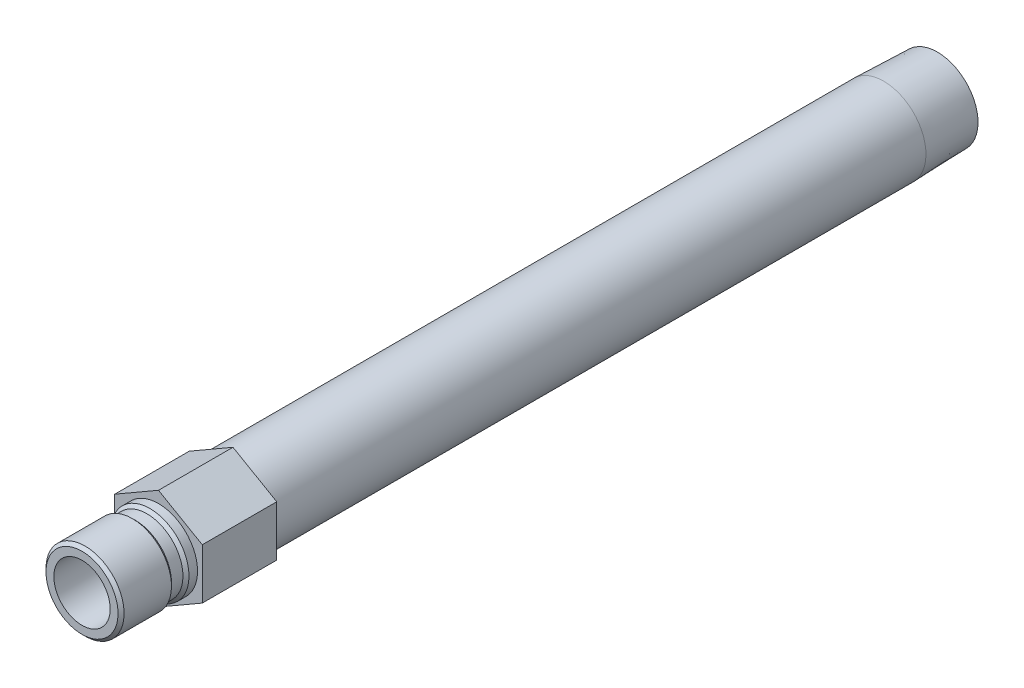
from build123d import *

# Parameters (mm, degrees)
SKETCH2_R           = 7.112
BOSS_EXTRUDE1_DEPTH = 18.796


with BuildPart() as part:
    # Sketch1 → Revolve1 (revolve)
    with BuildSketch(Plane(origin=(0, 0, 0), x_dir=(0, 0, -1), z_dir=(1, 0, 0))):
        Polygon((-19.304, 7.112), (-19.304, 9.0932), (-18.542, 9.8552), (-6.5786, 9.8552), (-5.8166, 9.0932), (-2.921, 9.0932), (-2.159, 9.8552), (0, 9.8552), (0, 10.668), (183.0324, 10.668), (196.596, 10.244140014), (196.596, 7.8994), (-1.105331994, 7.8994), (-1.524, 7.112), align=None)
    revolve(axis=Axis((0, 0, 0), (0, 0, 1)))

    # Sketch2 → Boss-Extrude1 (add)
    with BuildSketch(Plane.XY):
        Polygon((-11.049, 6.379143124), (-11.049, -6.379143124), (0, -12.758286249), (11.049, -6.379143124), (11.049, 6.379143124), (0, 12.758286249), align=None)
        with Locations(Location((0, 0, 0), (0, 0, 90))):
            Circle(SKETCH2_R, mode=Mode.SUBTRACT)
    extrude(amount=-BOSS_EXTRUDE1_DEPTH)


solid = part.part
